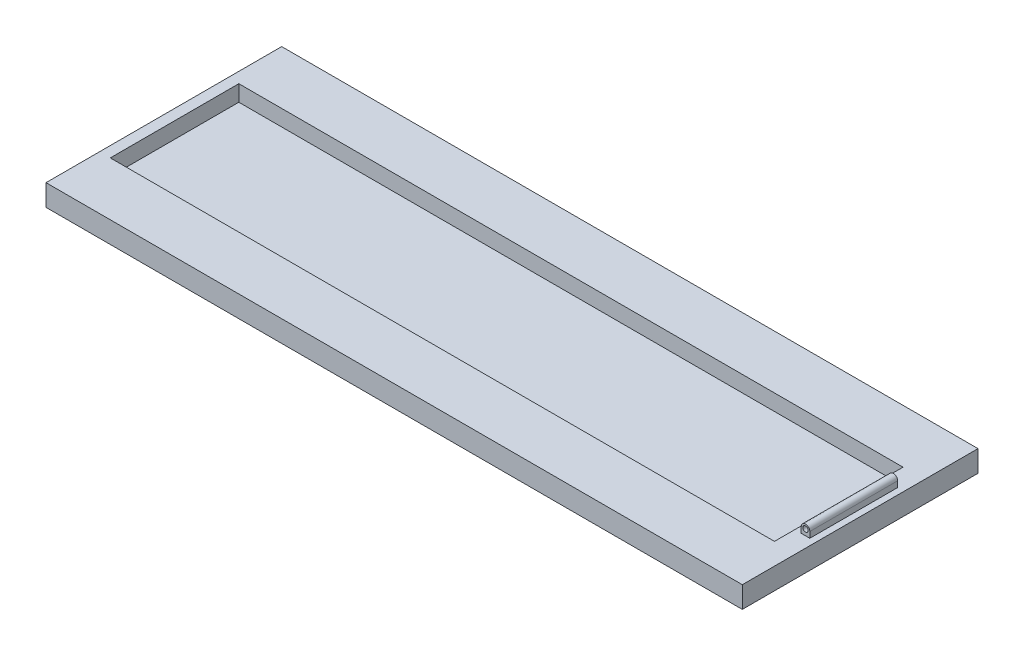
from build123d import *

# Parameters (mm, degrees)
ESQUISSE1_W             = 6500
ESQUISSE1_H             = 200
EXTRUSION1_DEPTH        = 1100
ESQUISSE2_R             = 25
EXTRUSION2_DEPTH        = 410
ESQUISSE3_W             = 6200
ESQUISSE3_H             = 1200
ENL_V_MAT_EXTRU_1_DEPTH = 150


with BuildPart() as part:
    # Esquisse1 → Extrusion1 (new, symmetric)
    with BuildSketch(Plane.XY):
        with Locations((-3150, -155)):
            Rectangle(ESQUISSE1_W, ESQUISSE1_H)
    extrude(amount=EXTRUSION1_DEPTH, both=True)

    # Esquisse2 → Extrusion2 (add, symmetric)
    with BuildSketch(Plane.XY):
        with BuildLine():
            Line((-40, 0), (-40, -55))
            Line((-40, -55), (40, -55))
            Line((40, -55), (40, 0))
            ThreePointArc((40, 0), (0, 40), (-40, 0))
        make_face()
        with Locations(Location((0, 0, 0), (0, 0, 180))):
            Circle(ESQUISSE2_R, mode=Mode.SUBTRACT)
    extrude(amount=EXTRUSION2_DEPTH, both=True)

    # Esquisse3 → Enl_v. mat.-Extru.1 (cut)
    with BuildSketch(Plane(origin=(0, -55, 0), x_dir=(1, 0, 0), z_dir=(0, 1, 0))):
        with Locations((-3200, 0)):
            Rectangle(ESQUISSE3_W, ESQUISSE3_H)
    extrude(amount=-ENL_V_MAT_EXTRU_1_DEPTH, mode=Mode.SUBTRACT)


solid = part.part
